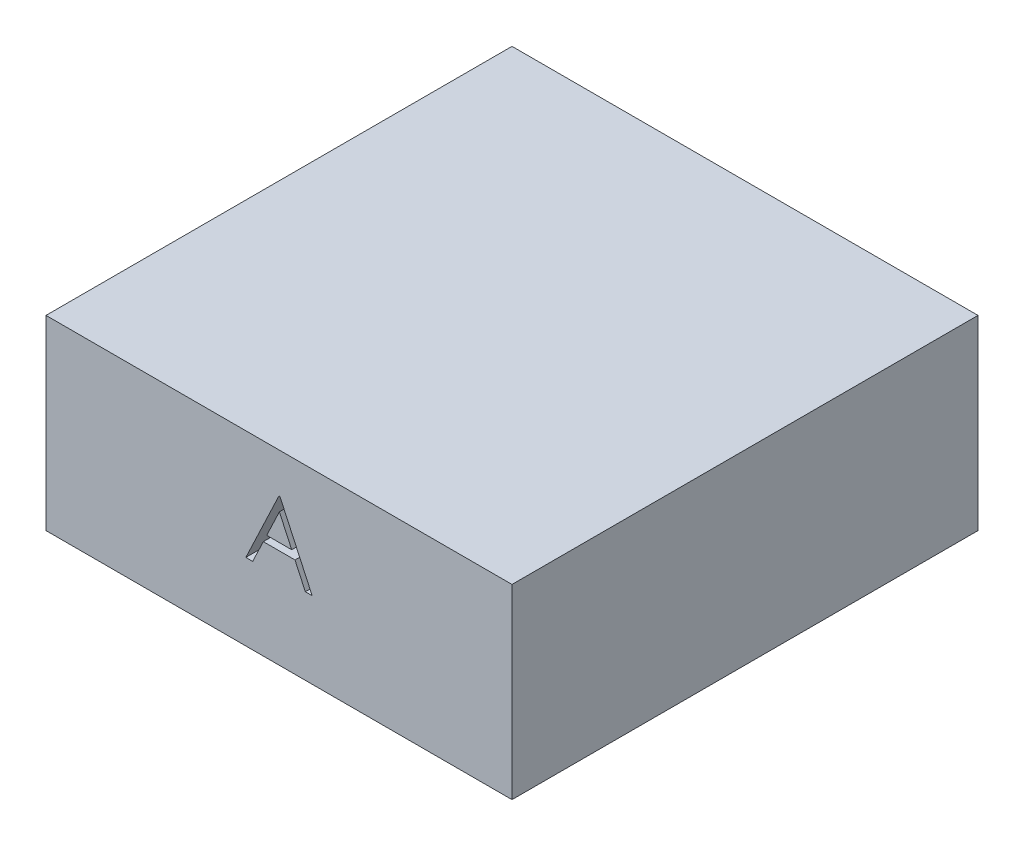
from build123d import *

# Parameters (mm, degrees)
FILLET1_R           = 1
FILLET2_R           = 5
SKETCH3_W           = 100
SKETCH3_H           = 100
BOSS_EXTRUDE1_DEPTH = 45
SKETCH5_W           = 9.158381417
SKETCH5_H           = 5.151589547
SKETCH5_W_2         = 10.303179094
SKETCH5_H_2         = 11.734176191
SKETCH5_W_3         = 7.154985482
SKETCH5_H_3         = 20.606358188
SKETCH5_W_4         = 8.29978316
SKETCH5_H_4         = 9.158381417
BOSS_EXTRUDE2_DEPTH = 15
CUT_EXTRUDE1_DEPTH  = 5
SKETCH7_W           = 100
SKETCH7_H           = 100
BOSS_EXTRUDE3_DEPTH = 40
CUT_EXTRUDE2_DEPTH  = 5


with BuildPart() as part:
    # Sketch1 → Revolve1 (revolve)
    with BuildSketch(Plane.XY):
        with BuildLine():
            ThreePointArc((26.438477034, 26.594302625), (37.5, 0), (26.438477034, -26.594302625))
            Line((26.438477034, -26.594302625), (18.438477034, -26.594302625))
            Line((18.438477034, -26.594302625), (15.632766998, -34.08616429))
            ThreePointArc((15.632766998, -34.08616429), (11.926184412, -35.553004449), (8.084838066, -36.618101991))
            Line((8.084838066, -36.618101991), (4.436473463, -26.594302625))
            Line((4.436473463, -26.594302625), (0, -26.594302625))
            Line((0, -26.594302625), (0, 26.594302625))
            Line((0, 26.594302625), (4.436473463, 26.594302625))
            Line((4.436473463, 26.594302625), (8.084838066, 36.618101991))
            ThreePointArc((8.084838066, 36.618101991), (11.926184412, 35.553004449), (15.632766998, 34.08616429))
            Line((15.632766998, 34.08616429), (18.438477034, 26.594302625))
            Line((18.438477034, 26.594302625), (26.438477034, 26.594302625))
        make_face()
    revolve(axis=Axis((0, 26.594302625, 0), (0, -1, 0)))

    # Fillet1
    fillet1_edges = [part.edges().sort_by_distance(p)[0] for p in [
        (-18.438477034, -26.594302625, 0),
        (-15.632766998, -34.08616429, 0),
        (-8.084838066, -36.618101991, 0),
        (-4.436473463, -26.594302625, 0),
        (-4.436473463, 26.594302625, 0),
        (-8.084838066, 36.618101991, 0),
        (-15.632766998, 34.08616429, 0),
        (-18.438477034, 26.594302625, 0),
    ]]
    fillet(fillet1_edges, radius=FILLET1_R)

    # Fillet2
    fillet2_edges = [part.edges().sort_by_distance(p)[0] for p in [
        (-26.438477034, -26.594302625, 0),
        (-26.438477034, 26.594302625, 0),
    ]]
    fillet(fillet2_edges, radius=FILLET2_R)


with BuildPart() as body_2:
    # Sketch3 → Boss-Extrude1 (new body)
    with BuildSketch(Plane(origin=(0, 0, 0), x_dir=(1, 0, 0), z_dir=(0, 1, 0))):
        Rectangle(SKETCH3_W, SKETCH3_H)
    extrude(amount=-BOSS_EXTRUDE1_DEPTH)

    # Sketch5 → Boss-Extrude2 (add)
    with BuildSketch(Plane(origin=(0, 0, 0), x_dir=(1, 0, 0), z_dir=(0, 1, 0))):
        with Locations((-42.357514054, 40.497217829)):
            Rectangle(SKETCH5_W, SKETCH5_H)
        with Locations((38.064522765, 40.497217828)):
            Rectangle(SKETCH5_W_2, SKETCH5_H_2)
        with Locations((-42.357514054, -33.914631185)):
            Rectangle(SKETCH5_W_3, SKETCH5_H_3)
        with Locations((34.343930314, -36.919725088)):
            Rectangle(SKETCH5_W_4, SKETCH5_H_4)
    extrude(amount=BOSS_EXTRUDE2_DEPTH)

    # Sketch6 → Cut-Extrude1 (cut)
    with BuildSketch(Plane.XY.offset(50)):
        with BuildLine():
            Line((-4.038461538, -10.955866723), (-1.111778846, -10.955866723))
            add(Edge.make_bspline(
                [(-1.111778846, -10.955866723), (-0.96851394, -10.956619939), (-0.690830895, -10.958079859), (-0.287033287, -10.980721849), (0.091175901, -11.01159472), (0.443906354, -11.060580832), (0.770995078, -11.119688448), (1.073427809, -11.19126766), (1.350242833, -11.277096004), (1.680725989, -11.413580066), (2.057528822, -11.616393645), (2.465521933, -11.916087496), (2.814397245, -12.282655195), (3.115195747, -12.696152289), (3.354343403, -13.151019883), (3.527354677, -13.636416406), (3.636888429, -14.146081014), (3.648153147, -14.495980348), (3.653846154, -14.672813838)],
                knots=[0, 0, 0, 0, 1.001505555, 1.941167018, 2.826882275, 3.653841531, 4.429895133, 5.150066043, 5.825578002, 6.45369114, 7.647487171, 8.808567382, 9.977351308, 11.170798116, 12.373658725, 13.556498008, 14.765093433, 16, 16, 16, 16], degree=3))
            add(Edge.make_bspline(
                [(3.653846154, -14.672813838), (3.649160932, -14.838467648), (3.639954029, -15.163993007), (3.551913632, -15.640110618), (3.414082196, -16.093330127), (3.222488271, -16.521997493), (2.973479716, -16.916427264), (2.678372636, -17.279801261), (2.322329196, -17.596734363), (2.055572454, -17.773918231), (1.920072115, -17.863919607)],
                knots=[0, 0, 0, 0, 1.044552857, 2.05264487, 3.044412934, 4.028983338, 5.005914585, 5.980388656, 6.974128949, 8, 8, 8, 8], degree=3))
            add(Edge.make_bspline(
                [(1.920072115, -17.863919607), (2.090473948, -17.929341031), (2.416494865, -18.054508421), (2.865149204, -18.275803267), (3.25169854, -18.516498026), (3.57911488, -18.779348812), (3.859133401, -19.062672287), (4.103646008, -19.370622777), (4.312280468, -19.707217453), (4.491050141, -20.068946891), (4.63054481, -20.452117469), (4.735012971, -20.853135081), (4.794873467, -21.270561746), (4.80339193, -21.554641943), (4.807692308, -21.698054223)],
                knots=[0, 0, 0, 0, 1.27268992, 2.434971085, 3.483601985, 4.442670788, 5.356604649, 6.2567628, 7.179492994, 8.113709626, 9.066344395, 10.018646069, 10.999752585, 12, 12, 12, 12], degree=3))
            add(Edge.make_bspline(
                [(4.807692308, -21.698054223), (4.803505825, -21.844483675), (4.795268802, -22.132587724), (4.734497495, -22.555824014), (4.631601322, -22.960288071), (4.489867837, -23.348595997), (4.304886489, -23.719996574), (4.079766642, -24.074910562), (3.811345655, -24.409771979), (3.511076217, -24.728301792), (3.171381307, -25.014706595), (2.804885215, -25.26977391), (2.406972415, -25.479542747), (1.984178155, -25.655754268), (1.531759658, -25.790356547), (1.051748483, -25.884524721), (0.544558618, -25.947974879), (0.196516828, -25.953191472), (0.018028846, -25.955866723)],
                knots=[0, 0, 0, 0, 0.978564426, 1.925352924, 2.850884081, 3.763762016, 4.682927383, 5.618979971, 6.567305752, 7.547517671, 8.540179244, 9.531824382, 10.526200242, 11.540722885, 12.589160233, 13.674978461, 14.80764778, 16, 16, 16, 16], degree=3))
            Line((0.018028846, -25.955866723), (-4.038461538, -25.955866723))
            Line((-4.038461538, -25.955866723), (-4.038461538, -10.955866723))
        make_face()
        with BuildLine():
            Line((-2.692307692, -12.494328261), (-2.692307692, -17.302020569))
            Line((-2.692307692, -17.302020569), (-1.787860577, -17.302020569))
            add(Edge.make_bspline(
                [(-1.787860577, -17.302020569), (-1.655651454, -17.300306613), (-1.400196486, -17.296994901), (-1.030254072, -17.2875084), (-0.686861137, -17.260945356), (-0.370610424, -17.234389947), (-0.081999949, -17.191213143), (0.178330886, -17.139818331), (0.41446773, -17.085463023), (0.686780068, -16.993022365), (0.995664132, -16.856403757), (1.324948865, -16.644381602), (1.615239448, -16.39184866), (1.860370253, -16.100458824), (2.060990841, -15.779603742), (2.200335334, -15.434402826), (2.294823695, -15.073459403), (2.30335883, -14.825666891), (2.307692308, -14.699857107)],
                knots=[0, 0, 0, 0, 1.156816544, 2.235205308, 3.236616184, 4.169592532, 5.011045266, 5.787822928, 6.49130361, 7.128639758, 8.301311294, 9.436451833, 10.541879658, 11.654887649, 12.756523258, 13.837046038, 14.901820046, 16, 16, 16, 16], degree=3))
            add(Edge.make_bspline(
                [(2.307692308, -14.699857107), (2.30543725, -14.616603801), (2.301013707, -14.453293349), (2.264785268, -14.215224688), (2.203209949, -13.991322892), (2.12412012, -13.778519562), (2.013597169, -13.583468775), (1.88346804, -13.399426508), (1.726243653, -13.232660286), (1.547283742, -13.076791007), (1.341532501, -12.938600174), (1.109112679, -12.817568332), (0.846879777, -12.72010786), (0.559253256, -12.634752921), (0.241805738, -12.57480309), (-0.101799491, -12.52486), (-0.474376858, -12.499433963), (-0.732141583, -12.496068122), (-0.865384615, -12.494328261)],
                knots=[0, 0, 0, 0, 0.91205012, 1.789085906, 2.630437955, 3.453916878, 4.269457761, 5.079663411, 5.91843418, 6.774407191, 7.675494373, 8.627863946, 9.638891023, 10.736472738, 11.911756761, 13.175263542, 14.539845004, 16, 16, 16, 16], degree=3))
            Line((-0.865384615, -12.494328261), (-2.692307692, -12.494328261))
        make_face(mode=Mode.SUBTRACT)
        with BuildLine():
            Line((-2.692307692, -18.840482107), (-2.692307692, -24.417405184))
            Line((-2.692307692, -24.417405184), (-0.775240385, -24.417405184))
            add(Edge.make_bspline(
                [(-0.775240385, -24.417405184), (-0.638016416, -24.415760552), (-0.373535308, -24.412590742), (0.008327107, -24.402242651), (0.362254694, -24.378704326), (0.686632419, -24.341650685), (0.98496293, -24.301457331), (1.253667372, -24.247408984), (1.494923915, -24.185484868), (1.774670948, -24.089766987), (2.089685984, -23.941067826), (2.429161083, -23.716863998), (2.730987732, -23.449764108), (2.987295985, -23.140631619), (3.197351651, -22.80449736), (3.350160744, -22.448160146), (3.444407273, -22.077507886), (3.45581657, -21.824793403), (3.461538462, -21.698054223)],
                knots=[0, 0, 0, 0, 1.160039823, 2.235823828, 3.228722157, 4.157150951, 4.99529583, 5.772374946, 6.472645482, 7.099169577, 8.269452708, 9.405989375, 10.527446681, 11.663510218, 12.788923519, 13.866172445, 14.929861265, 16, 16, 16, 16], degree=3))
            add(Edge.make_bspline(
                [(3.461538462, -21.698054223), (3.460355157, -21.618797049), (3.458007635, -21.461561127), (3.422605, -21.23049333), (3.371116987, -21.006668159), (3.304553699, -20.789477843), (3.207613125, -20.582849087), (3.094442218, -20.38269526), (2.961750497, -20.188751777), (2.754989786, -19.943556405), (2.454252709, -19.661054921), (2.026937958, -19.384465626), (1.54105668, -19.161403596), (1.18865314, -19.066691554), (1.006610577, -19.017765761)],
                knots=[0, 0, 0, 0, 0.723448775, 1.435228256, 2.130040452, 2.821711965, 3.505591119, 4.210454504, 4.921174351, 5.648778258, 7.137944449, 8.670945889, 10.280296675, 12, 12, 12, 12], degree=3))
            add(Edge.make_bspline(
                [(1.006610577, -19.017765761), (0.933628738, -19.002958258), (0.775389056, -18.970852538), (0.517356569, -18.936962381), (0.222774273, -18.906769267), (-0.109038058, -18.884435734), (-0.478500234, -18.861350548), (-0.886401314, -18.852372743), (-1.33107552, -18.841661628), (-1.639614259, -18.840885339), (-1.799879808, -18.840482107)],
                knots=[0, 0, 0, 0, 0.634451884, 1.375622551, 2.216452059, 3.157844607, 4.20941857, 5.370758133, 6.634282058, 8, 8, 8, 8], degree=3))
            Line((-1.799879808, -18.840482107), (-2.692307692, -18.840482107))
        make_face(mode=Mode.SUBTRACT)
    extrude(amount=-CUT_EXTRUDE1_DEPTH, mode=Mode.SUBTRACT)


with BuildPart() as part_1:
    add(part.part)

    # Combine2: union body 2
    add(body_2.part)


with BuildPart() as body_2_2:
    # Sketch7 → Boss-Extrude3 (new body)
    with BuildSketch(Plane(origin=(0, 0, 0), x_dir=(1, 0, 0), z_dir=(0, 1, 0))):
        Rectangle(SKETCH7_W, SKETCH7_H)
    extrude(amount=BOSS_EXTRUDE3_DEPTH)

    # Combine3: cut part
    add(part_1.part, mode=Mode.SUBTRACT)

    # Sketch8 → Cut-Extrude2 (cut)
    with BuildSketch(Plane.XY.offset(50)):
        Polygon((0.192307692, 31.461534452), (7.115384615, 16.461534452), (5.652043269, 16.461534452), (3.434495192, 21.26922676), (-3.365384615, 21.26922676), (-5.646033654, 16.461534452), (-7.115384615, 16.461534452), (0, 31.461534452), align=None)
        Polygon((0.081129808, 28.537856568), (-2.635216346, 22.807688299), (2.725360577, 22.807688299), align=None, mode=Mode.SUBTRACT)
    extrude(amount=-CUT_EXTRUDE2_DEPTH, mode=Mode.SUBTRACT)


solid = body_2_2.part
